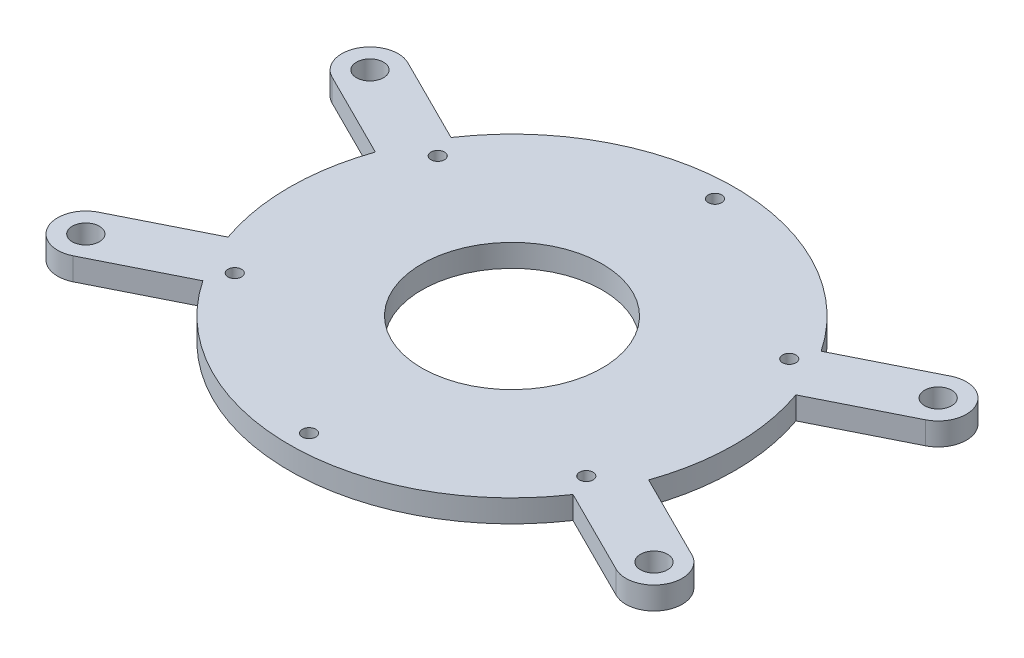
ISO-10303-21;
HEADER;
FILE_DESCRIPTION(('STEP AP214'),'2;1');
FILE_NAME('part.step','',(''),(''),'','','');
FILE_SCHEMA(('AUTOMOTIVE_DESIGN { 1 0 10303 214 1 1 1 1 }'));
ENDSEC;
DATA;
#1=APPLICATION_CONTEXT('core data for automotive mechanical design processes');
#2=APPLICATION_PROTOCOL_DEFINITION('international standard','automotive_design',2000,#1);
#3=PRODUCT_CONTEXT('',#1,'mechanical');
#4=PRODUCT('Part','Part','',(#3));
#5=PRODUCT_RELATED_PRODUCT_CATEGORY('part','',(#4));
#6=PRODUCT_DEFINITION_FORMATION('','',#4);
#7=PRODUCT_DEFINITION_CONTEXT('part definition',#1,'design');
#8=PRODUCT_DEFINITION('design','',#6,#7);
#9=PRODUCT_DEFINITION_SHAPE('','',#8);
#10=(LENGTH_UNIT() NAMED_UNIT(*) SI_UNIT(.MILLI.,.METRE.));
#11=(NAMED_UNIT(*) PLANE_ANGLE_UNIT() SI_UNIT($,.RADIAN.));
#12=(NAMED_UNIT(*) SI_UNIT($,.STERADIAN.) SOLID_ANGLE_UNIT());
#13=UNCERTAINTY_MEASURE_WITH_UNIT(LENGTH_MEASURE(1.E-05),#10,'distance_accuracy_value','');
#14=(GEOMETRIC_REPRESENTATION_CONTEXT(3) GLOBAL_UNCERTAINTY_ASSIGNED_CONTEXT((#13)) GLOBAL_UNIT_ASSIGNED_CONTEXT((#10,
#11,#12)) REPRESENTATION_CONTEXT('',''));
#15=CARTESIAN_POINT('',(0.,0.,0.));
#16=DIRECTION('',(0.,0.,1.));
#17=DIRECTION('',(1.,0.,0.));
#18=AXIS2_PLACEMENT_3D('',#15,#16,#17);
#19=CARTESIAN_POINT('',(0.,5.,0.));
#20=DIRECTION('',(0.,-1.,0.));
#21=DIRECTION('',(0.,0.,-1.));
#22=AXIS2_PLACEMENT_3D('',#19,#20,#21);
#23=CYLINDRICAL_SURFACE('',#22,49.4);
#24=CARTESIAN_POINT('',(0.,0.,0.));
#25=DIRECTION('',(0.,1.,0.));
#26=DIRECTION('',(0.,0.,1.));
#27=AXIS2_PLACEMENT_3D('',#24,#25,#26);
#28=CIRCLE('',#27,49.4);
#29=CARTESIAN_POINT('',(-41.0321866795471,0.,27.5085378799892));
#30=VERTEX_POINT('',#29);
#31=CARTESIAN_POINT('',(41.0321866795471,0.,27.5085378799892));
#32=VERTEX_POINT('',#31);
#33=EDGE_CURVE('E246',#30,#32,#28,.T.);
#34=ORIENTED_EDGE('',*,*,#33,.T.);
#35=DIRECTION('',(0.,-1.,0.));
#36=VECTOR('',#35,1.);
#37=CARTESIAN_POINT('',(41.0321866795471,5.,27.5085378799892));
#38=LINE('',#37,#36);
#39=CARTESIAN_POINT('',(41.0321866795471,5.,27.5085378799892));
#40=VERTEX_POINT('',#39);
#41=EDGE_CURVE('E12',#40,#32,#38,.T.);
#42=ORIENTED_EDGE('',*,*,#41,.F.);
#43=CARTESIAN_POINT('',(0.,5.,0.));
#44=DIRECTION('',(0.,1.,0.));
#45=DIRECTION('',(0.,0.,1.));
#46=AXIS2_PLACEMENT_3D('',#43,#44,#45);
#47=CIRCLE('',#46,49.4);
#48=CARTESIAN_POINT('',(-41.0321866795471,5.,27.5085378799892));
#49=VERTEX_POINT('',#48);
#50=EDGE_CURVE('E176',#49,#40,#47,.T.);
#51=ORIENTED_EDGE('',*,*,#50,.F.);
#52=DIRECTION('',(0.,-1.,0.));
#53=VECTOR('',#52,1.);
#54=CARTESIAN_POINT('',(-41.0321866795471,5.,27.5085378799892));
#55=LINE('',#54,#53);
#56=EDGE_CURVE('E242',#49,#30,#55,.T.);
#57=ORIENTED_EDGE('',*,*,#56,.T.);
#58=EDGE_LOOP('',(#34,#42,#51,#57));
#59=FACE_BOUND('',#58,.T.);
#60=ADVANCED_FACE('F94',(#59),#23,.T.);
#61=CARTESIAN_POINT('',(-2.79556780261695,5.,5.5899285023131));
#62=DIRECTION('',(-0.447290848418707,0.,0.894388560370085));
#63=DIRECTION('',(0.894388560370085,0.,0.447290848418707));
#64=AXIS2_PLACEMENT_3D('',#61,#62,#63);
#65=PLANE('',#64);
#66=DIRECTION('',(-0.894388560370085,0.,-0.447290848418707));
#67=VECTOR('',#66,1.);
#68=CARTESIAN_POINT('',(-2.79556780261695,0.,5.5899285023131));
#69=LINE('',#68,#67);
#70=CARTESIAN_POINT('',(60.1908307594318,0.,37.089928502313));
#71=VERTEX_POINT('',#70);
#72=EDGE_CURVE('E250',#71,#32,#69,.T.);
#73=ORIENTED_EDGE('',*,*,#72,.F.);
#74=DIRECTION('',(0.,-1.,0.));
#75=VECTOR('',#74,1.);
#76=CARTESIAN_POINT('',(60.1908307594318,5.,37.089928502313));
#77=LINE('',#76,#75);
#78=CARTESIAN_POINT('',(60.1908307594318,5.,37.089928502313));
#79=VERTEX_POINT('',#78);
#80=EDGE_CURVE('E104',#79,#71,#77,.T.);
#81=ORIENTED_EDGE('',*,*,#80,.F.);
#82=DIRECTION('',(-0.894388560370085,0.,-0.447290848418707));
#83=VECTOR('',#82,1.);
#84=CARTESIAN_POINT('',(-2.79556780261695,5.,5.5899285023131));
#85=LINE('',#84,#83);
#86=EDGE_CURVE('E326',#79,#40,#85,.T.);
#87=ORIENTED_EDGE('',*,*,#86,.T.);
#88=ORIENTED_EDGE('',*,*,#41,.T.);
#89=EDGE_LOOP('',(#73,#81,#87,#88));
#90=FACE_BOUND('',#89,.T.);
#91=ADVANCED_FACE('F407',(#90),#65,.T.);
#92=CARTESIAN_POINT('',(62.9863985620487,5.,31.5));
#93=DIRECTION('',(0.,-1.,0.));
#94=DIRECTION('',(0.,0.,-1.));
#95=AXIS2_PLACEMENT_3D('',#92,#93,#94);
#96=CYLINDRICAL_SURFACE('',#95,6.25);
#97=CARTESIAN_POINT('',(62.9863985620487,0.,31.5));
#98=DIRECTION('',(0.,1.,0.));
#99=DIRECTION('',(0.,0.,1.));
#100=AXIS2_PLACEMENT_3D('',#97,#98,#99);
#101=CIRCLE('',#100,6.25);
#102=CARTESIAN_POINT('',(65.7819663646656,0.,25.9100714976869));
#103=VERTEX_POINT('',#102);
#104=EDGE_CURVE('E255',#103,#71,#101,.F.);
#105=ORIENTED_EDGE('',*,*,#104,.F.);
#106=DIRECTION('',(0.,-1.,0.));
#107=VECTOR('',#106,1.);
#108=CARTESIAN_POINT('',(65.7819663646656,5.,25.9100714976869));
#109=LINE('',#108,#107);
#110=CARTESIAN_POINT('',(65.7819663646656,5.,25.9100714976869));
#111=VERTEX_POINT('',#110);
#112=EDGE_CURVE('E302',#111,#103,#109,.T.);
#113=ORIENTED_EDGE('',*,*,#112,.F.);
#114=CARTESIAN_POINT('',(62.9863985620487,5.,31.5));
#115=DIRECTION('',(0.,1.,0.));
#116=DIRECTION('',(0.,0.,1.));
#117=AXIS2_PLACEMENT_3D('',#114,#115,#116);
#118=CIRCLE('',#117,6.25);
#119=EDGE_CURVE('E330',#111,#79,#118,.F.);
#120=ORIENTED_EDGE('',*,*,#119,.T.);
#121=ORIENTED_EDGE('',*,*,#80,.T.);
#122=EDGE_LOOP('',(#105,#113,#120,#121));
#123=FACE_BOUND('',#122,.T.);
#124=ADVANCED_FACE('F412',(#123),#96,.T.);
#125=CARTESIAN_POINT('',(2.79556780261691,5.,-5.58992850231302));
#126=DIRECTION('',(-0.447290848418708,0.,0.894388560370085));
#127=DIRECTION('',(0.894388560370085,0.,0.447290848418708));
#128=AXIS2_PLACEMENT_3D('',#125,#126,#127);
#129=PLANE('',#128);
#130=DIRECTION('',(-0.894388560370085,0.,-0.447290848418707));
#131=VECTOR('',#130,1.);
#132=CARTESIAN_POINT('',(2.79556780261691,0.,-5.58992850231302));
#133=LINE('',#132,#131);
#134=CARTESIAN_POINT('',(46.623322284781,0.,16.3286808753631));
#135=VERTEX_POINT('',#134);
#136=EDGE_CURVE('E258',#103,#135,#133,.T.);
#137=ORIENTED_EDGE('',*,*,#136,.T.);
#138=DIRECTION('',(0.,-1.,0.));
#139=VECTOR('',#138,1.);
#140=CARTESIAN_POINT('',(46.623322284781,5.,16.3286808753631));
#141=LINE('',#140,#139);
#142=CARTESIAN_POINT('',(46.623322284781,5.,16.3286808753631));
#143=VERTEX_POINT('',#142);
#144=EDGE_CURVE('E299',#143,#135,#141,.T.);
#145=ORIENTED_EDGE('',*,*,#144,.F.);
#146=DIRECTION('',(-0.894388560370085,0.,-0.447290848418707));
#147=VECTOR('',#146,1.);
#148=CARTESIAN_POINT('',(2.79556780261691,5.,-5.58992850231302));
#149=LINE('',#148,#147);
#150=EDGE_CURVE('E333',#111,#143,#149,.T.);
#151=ORIENTED_EDGE('',*,*,#150,.F.);
#152=ORIENTED_EDGE('',*,*,#112,.T.);
#153=EDGE_LOOP('',(#137,#145,#151,#152));
#154=FACE_BOUND('',#153,.T.);
#155=ADVANCED_FACE('F418',(#154),#129,.F.);
#156=CARTESIAN_POINT('',(46.6233222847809,0.,-16.3286808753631));
#157=VERTEX_POINT('',#156);
#158=EDGE_CURVE('E252',#135,#157,#28,.T.);
#159=ORIENTED_EDGE('',*,*,#158,.T.);
#160=DIRECTION('',(0.,-1.,0.));
#161=VECTOR('',#160,1.);
#162=CARTESIAN_POINT('',(46.6233222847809,5.,-16.3286808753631));
#163=LINE('',#162,#161);
#164=CARTESIAN_POINT('',(46.6233222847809,5.,-16.3286808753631));
#165=VERTEX_POINT('',#164);
#166=EDGE_CURVE('E297',#165,#157,#163,.T.);
#167=ORIENTED_EDGE('',*,*,#166,.F.);
#168=EDGE_CURVE('E327',#143,#165,#47,.T.);
#169=ORIENTED_EDGE('',*,*,#168,.F.);
#170=ORIENTED_EDGE('',*,*,#144,.T.);
#171=EDGE_LOOP('',(#159,#167,#169,#170));
#172=FACE_BOUND('',#171,.T.);
#173=ADVANCED_FACE('F354',(#172),#23,.T.);
#174=CARTESIAN_POINT('',(2.79556780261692,5.,5.58992850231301));
#175=DIRECTION('',(0.447290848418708,0.,0.894388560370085));
#176=DIRECTION('',(0.894388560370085,0.,-0.447290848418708));
#177=AXIS2_PLACEMENT_3D('',#174,#175,#176);
#178=PLANE('',#177);
#179=DIRECTION('',(-0.894388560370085,0.,0.447290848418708));
#180=VECTOR('',#179,1.);
#181=CARTESIAN_POINT('',(2.79556780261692,0.,5.58992850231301));
#182=LINE('',#181,#180);
#183=CARTESIAN_POINT('',(65.7819663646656,0.,-25.910071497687));
#184=VERTEX_POINT('',#183);
#185=EDGE_CURVE('E260',#184,#157,#182,.T.);
#186=ORIENTED_EDGE('',*,*,#185,.F.);
#187=DIRECTION('',(0.,-1.,0.));
#188=VECTOR('',#187,1.);
#189=CARTESIAN_POINT('',(65.7819663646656,5.,-25.910071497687));
#190=LINE('',#189,#188);
#191=CARTESIAN_POINT('',(65.7819663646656,5.,-25.910071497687));
#192=VERTEX_POINT('',#191);
#193=EDGE_CURVE('E295',#192,#184,#190,.T.);
#194=ORIENTED_EDGE('',*,*,#193,.F.);
#195=DIRECTION('',(-0.894388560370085,0.,0.447290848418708));
#196=VECTOR('',#195,1.);
#197=CARTESIAN_POINT('',(2.79556780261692,5.,5.58992850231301));
#198=LINE('',#197,#196);
#199=EDGE_CURVE('E335',#192,#165,#198,.T.);
#200=ORIENTED_EDGE('',*,*,#199,.T.);
#201=ORIENTED_EDGE('',*,*,#166,.T.);
#202=EDGE_LOOP('',(#186,#194,#200,#201));
#203=FACE_BOUND('',#202,.T.);
#204=ADVANCED_FACE('F358',(#203),#178,.T.);
#205=CARTESIAN_POINT('',(62.9863985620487,5.,-31.5));
#206=DIRECTION('',(0.,-1.,0.));
#207=DIRECTION('',(0.,0.,-1.));
#208=AXIS2_PLACEMENT_3D('',#205,#206,#207);
#209=CYLINDRICAL_SURFACE('',#208,6.25);
#210=CARTESIAN_POINT('',(62.9863985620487,0.,-31.5));
#211=DIRECTION('',(0.,1.,0.));
#212=DIRECTION('',(0.,0.,1.));
#213=AXIS2_PLACEMENT_3D('',#210,#211,#212);
#214=CIRCLE('',#213,6.25);
#215=CARTESIAN_POINT('',(60.1908307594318,0.,-37.089928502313));
#216=VERTEX_POINT('',#215);
#217=EDGE_CURVE('E263',#184,#216,#214,.T.);
#218=ORIENTED_EDGE('',*,*,#217,.T.);
#219=DIRECTION('',(0.,-1.,0.));
#220=VECTOR('',#219,1.);
#221=CARTESIAN_POINT('',(60.1908307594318,5.,-37.089928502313));
#222=LINE('',#221,#220);
#223=CARTESIAN_POINT('',(60.1908307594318,5.,-37.089928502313));
#224=VERTEX_POINT('',#223);
#225=EDGE_CURVE('E292',#224,#216,#222,.T.);
#226=ORIENTED_EDGE('',*,*,#225,.F.);
#227=CARTESIAN_POINT('',(62.9863985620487,5.,-31.5));
#228=DIRECTION('',(0.,1.,0.));
#229=DIRECTION('',(0.,0.,1.));
#230=AXIS2_PLACEMENT_3D('',#227,#228,#229);
#231=CIRCLE('',#230,6.25);
#232=EDGE_CURVE('E338',#192,#224,#231,.T.);
#233=ORIENTED_EDGE('',*,*,#232,.F.);
#234=ORIENTED_EDGE('',*,*,#193,.T.);
#235=EDGE_LOOP('',(#218,#226,#233,#234));
#236=FACE_BOUND('',#235,.T.);
#237=ADVANCED_FACE('F363',(#236),#209,.T.);
#238=CARTESIAN_POINT('',(-2.79556780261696,5.,-5.58992850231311));
#239=DIRECTION('',(0.447290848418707,0.,0.894388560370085));
#240=DIRECTION('',(0.894388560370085,0.,-0.447290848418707));
#241=AXIS2_PLACEMENT_3D('',#238,#239,#240);
#242=PLANE('',#241);
#243=DIRECTION('',(-0.894388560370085,0.,0.447290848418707));
#244=VECTOR('',#243,1.);
#245=CARTESIAN_POINT('',(-2.79556780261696,0.,-5.58992850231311));
#246=LINE('',#245,#244);
#247=CARTESIAN_POINT('',(41.0321866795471,0.,-27.5085378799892));
#248=VERTEX_POINT('',#247);
#249=EDGE_CURVE('E265',#216,#248,#246,.T.);
#250=ORIENTED_EDGE('',*,*,#249,.T.);
#251=DIRECTION('',(0.,-1.,0.));
#252=VECTOR('',#251,1.);
#253=CARTESIAN_POINT('',(41.0321866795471,5.,-27.5085378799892));
#254=LINE('',#253,#252);
#255=CARTESIAN_POINT('',(41.0321866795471,5.,-27.5085378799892));
#256=VERTEX_POINT('',#255);
#257=EDGE_CURVE('E289',#256,#248,#254,.T.);
#258=ORIENTED_EDGE('',*,*,#257,.F.);
#259=DIRECTION('',(-0.894388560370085,0.,0.447290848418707));
#260=VECTOR('',#259,1.);
#261=CARTESIAN_POINT('',(-2.79556780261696,5.,-5.58992850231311));
#262=LINE('',#261,#260);
#263=EDGE_CURVE('E340',#224,#256,#262,.T.);
#264=ORIENTED_EDGE('',*,*,#263,.F.);
#265=ORIENTED_EDGE('',*,*,#225,.T.);
#266=EDGE_LOOP('',(#250,#258,#264,#265));
#267=FACE_BOUND('',#266,.T.);
#268=ADVANCED_FACE('F367',(#267),#242,.F.);
#269=CARTESIAN_POINT('',(-41.0321866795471,0.,-27.5085378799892));
#270=VERTEX_POINT('',#269);
#271=EDGE_CURVE('E267',#248,#270,#28,.T.);
#272=ORIENTED_EDGE('',*,*,#271,.T.);
#273=DIRECTION('',(0.,-1.,0.));
#274=VECTOR('',#273,1.);
#275=CARTESIAN_POINT('',(-41.0321866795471,5.,-27.5085378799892));
#276=LINE('',#275,#274);
#277=CARTESIAN_POINT('',(-41.0321866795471,5.,-27.5085378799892));
#278=VERTEX_POINT('',#277);
#279=EDGE_CURVE('E287',#278,#270,#276,.T.);
#280=ORIENTED_EDGE('',*,*,#279,.F.);
#281=EDGE_CURVE('E237',#256,#278,#47,.T.);
#282=ORIENTED_EDGE('',*,*,#281,.F.);
#283=ORIENTED_EDGE('',*,*,#257,.T.);
#284=EDGE_LOOP('',(#272,#280,#282,#283));
#285=FACE_BOUND('',#284,.T.);
#286=ADVANCED_FACE('F372',(#285),#23,.T.);
#287=CARTESIAN_POINT('',(2.79556780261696,5.,-5.58992850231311));
#288=DIRECTION('',(0.447290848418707,0.,-0.894388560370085));
#289=DIRECTION('',(-0.894388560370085,0.,-0.447290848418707));
#290=AXIS2_PLACEMENT_3D('',#287,#288,#289);
#291=PLANE('',#290);
#292=DIRECTION('',(0.894388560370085,0.,0.447290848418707));
#293=VECTOR('',#292,1.);
#294=CARTESIAN_POINT('',(2.79556780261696,0.,-5.58992850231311));
#295=LINE('',#294,#293);
#296=CARTESIAN_POINT('',(-60.1908307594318,0.,-37.089928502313));
#297=VERTEX_POINT('',#296);
#298=EDGE_CURVE('E268',#297,#270,#295,.T.);
#299=ORIENTED_EDGE('',*,*,#298,.F.);
#300=DIRECTION('',(0.,-1.,0.));
#301=VECTOR('',#300,1.);
#302=CARTESIAN_POINT('',(-60.1908307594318,5.,-37.089928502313));
#303=LINE('',#302,#301);
#304=CARTESIAN_POINT('',(-60.1908307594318,5.,-37.089928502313));
#305=VERTEX_POINT('',#304);
#306=EDGE_CURVE('E285',#305,#297,#303,.T.);
#307=ORIENTED_EDGE('',*,*,#306,.F.);
#308=DIRECTION('',(0.894388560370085,0.,0.447290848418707));
#309=VECTOR('',#308,1.);
#310=CARTESIAN_POINT('',(2.79556780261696,5.,-5.58992850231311));
#311=LINE('',#310,#309);
#312=EDGE_CURVE('E341',#305,#278,#311,.T.);
#313=ORIENTED_EDGE('',*,*,#312,.T.);
#314=ORIENTED_EDGE('',*,*,#279,.T.);
#315=EDGE_LOOP('',(#299,#307,#313,#314));
#316=FACE_BOUND('',#315,.T.);
#317=ADVANCED_FACE('F373',(#316),#291,.T.);
#318=CARTESIAN_POINT('',(-2.7955678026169,5.,5.58992850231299));
#319=DIRECTION('',(0.447290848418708,0.,-0.894388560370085));
#320=DIRECTION('',(-0.894388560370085,0.,-0.447290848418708));
#321=AXIS2_PLACEMENT_3D('',#318,#319,#320);
#322=PLANE('',#321);
#323=DIRECTION('',(0.894388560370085,0.,0.447290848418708));
#324=VECTOR('',#323,1.);
#325=CARTESIAN_POINT('',(-2.7955678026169,0.,5.58992850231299));
#326=LINE('',#325,#324);
#327=CARTESIAN_POINT('',(-65.7819663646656,0.,-25.9100714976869));
#328=VERTEX_POINT('',#327);
#329=CARTESIAN_POINT('',(-46.6233222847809,0.,-16.3286808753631));
#330=VERTEX_POINT('',#329);
#331=EDGE_CURVE('E271',#328,#330,#326,.T.);
#332=ORIENTED_EDGE('',*,*,#331,.T.);
#333=DIRECTION('',(0.,-1.,0.));
#334=VECTOR('',#333,1.);
#335=CARTESIAN_POINT('',(-46.6233222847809,5.,-16.3286808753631));
#336=LINE('',#335,#334);
#337=CARTESIAN_POINT('',(-46.6233222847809,5.,-16.3286808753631));
#338=VERTEX_POINT('',#337);
#339=EDGE_CURVE('E280',#338,#330,#336,.T.);
#340=ORIENTED_EDGE('',*,*,#339,.F.);
#341=DIRECTION('',(0.894388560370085,0.,0.447290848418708));
#342=VECTOR('',#341,1.);
#343=CARTESIAN_POINT('',(-2.7955678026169,5.,5.58992850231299));
#344=LINE('',#343,#342);
#345=CARTESIAN_POINT('',(-65.7819663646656,5.,-25.9100714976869));
#346=VERTEX_POINT('',#345);
#347=EDGE_CURVE('E235',#346,#338,#344,.T.);
#348=ORIENTED_EDGE('',*,*,#347,.F.);
#349=DIRECTION('',(0.,-1.,0.));
#350=VECTOR('',#349,1.);
#351=CARTESIAN_POINT('',(-65.7819663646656,5.,-25.9100714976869));
#352=LINE('',#351,#350);
#353=EDGE_CURVE('E283',#346,#328,#352,.T.);
#354=ORIENTED_EDGE('',*,*,#353,.T.);
#355=EDGE_LOOP('',(#332,#340,#348,#354));
#356=FACE_BOUND('',#355,.T.);
#357=ADVANCED_FACE('F420',(#356),#322,.F.);
#358=CARTESIAN_POINT('',(-46.6233222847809,0.,16.3286808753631));
#359=VERTEX_POINT('',#358);
#360=EDGE_CURVE('E251',#330,#359,#28,.T.);
#361=ORIENTED_EDGE('',*,*,#360,.T.);
#362=DIRECTION('',(0.,-1.,0.));
#363=VECTOR('',#362,1.);
#364=CARTESIAN_POINT('',(-46.6233222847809,5.,16.3286808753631));
#365=LINE('',#364,#363);
#366=CARTESIAN_POINT('',(-46.6233222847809,5.,16.3286808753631));
#367=VERTEX_POINT('',#366);
#368=EDGE_CURVE('E224',#367,#359,#365,.T.);
#369=ORIENTED_EDGE('',*,*,#368,.F.);
#370=EDGE_CURVE('E232',#338,#367,#47,.T.);
#371=ORIENTED_EDGE('',*,*,#370,.F.);
#372=ORIENTED_EDGE('',*,*,#339,.T.);
#373=EDGE_LOOP('',(#361,#369,#371,#372));
#374=FACE_BOUND('',#373,.T.);
#375=ADVANCED_FACE('F379',(#374),#23,.T.);
#376=CARTESIAN_POINT('',(-2.7955678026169,5.,-5.58992850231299));
#377=DIRECTION('',(-0.447290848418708,0.,-0.894388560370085));
#378=DIRECTION('',(-0.894388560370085,0.,0.447290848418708));
#379=AXIS2_PLACEMENT_3D('',#376,#377,#378);
#380=PLANE('',#379);
#381=DIRECTION('',(0.894388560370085,0.,-0.447290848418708));
#382=VECTOR('',#381,1.);
#383=CARTESIAN_POINT('',(-2.7955678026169,0.,-5.58992850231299));
#384=LINE('',#383,#382);
#385=CARTESIAN_POINT('',(-65.7819663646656,0.,25.9100714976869));
#386=VERTEX_POINT('',#385);
#387=EDGE_CURVE('E223',#386,#359,#384,.T.);
#388=ORIENTED_EDGE('',*,*,#387,.F.);
#389=DIRECTION('',(0.,-1.,0.));
#390=VECTOR('',#389,1.);
#391=CARTESIAN_POINT('',(-65.7819663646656,5.,25.9100714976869));
#392=LINE('',#391,#390);
#393=CARTESIAN_POINT('',(-65.7819663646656,5.,25.9100714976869));
#394=VERTEX_POINT('',#393);
#395=EDGE_CURVE('E217',#394,#386,#392,.T.);
#396=ORIENTED_EDGE('',*,*,#395,.F.);
#397=DIRECTION('',(0.894388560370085,0.,-0.447290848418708));
#398=VECTOR('',#397,1.);
#399=CARTESIAN_POINT('',(-2.7955678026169,5.,-5.58992850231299));
#400=LINE('',#399,#398);
#401=EDGE_CURVE('E221',#394,#367,#400,.T.);
#402=ORIENTED_EDGE('',*,*,#401,.T.);
#403=ORIENTED_EDGE('',*,*,#368,.T.);
#404=EDGE_LOOP('',(#388,#396,#402,#403));
#405=FACE_BOUND('',#404,.T.);
#406=ADVANCED_FACE('F219',(#405),#380,.T.);
#407=CARTESIAN_POINT('',(-62.9863985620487,5.,31.5));
#408=DIRECTION('',(0.,-1.,0.));
#409=DIRECTION('',(0.,0.,-1.));
#410=AXIS2_PLACEMENT_3D('',#407,#408,#409);
#411=CYLINDRICAL_SURFACE('',#410,6.25000000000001);
#412=CARTESIAN_POINT('',(-62.9863985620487,0.,31.5));
#413=DIRECTION('',(0.,1.,0.));
#414=DIRECTION('',(0.,0.,1.));
#415=AXIS2_PLACEMENT_3D('',#412,#413,#414);
#416=CIRCLE('',#415,6.25000000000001);
#417=CARTESIAN_POINT('',(-60.1908307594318,0.,37.089928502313));
#418=VERTEX_POINT('',#417);
#419=EDGE_CURVE('E164',#386,#418,#416,.T.);
#420=ORIENTED_EDGE('',*,*,#419,.T.);
#421=DIRECTION('',(0.,-1.,0.));
#422=VECTOR('',#421,1.);
#423=CARTESIAN_POINT('',(-60.1908307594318,5.,37.089928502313));
#424=LINE('',#423,#422);
#425=CARTESIAN_POINT('',(-60.1908307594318,5.,37.089928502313));
#426=VERTEX_POINT('',#425);
#427=EDGE_CURVE('E225',#426,#418,#424,.T.);
#428=ORIENTED_EDGE('',*,*,#427,.F.);
#429=CARTESIAN_POINT('',(-62.9863985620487,5.,31.5));
#430=DIRECTION('',(0.,1.,0.));
#431=DIRECTION('',(0.,0.,1.));
#432=AXIS2_PLACEMENT_3D('',#429,#430,#431);
#433=CIRCLE('',#432,6.25000000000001);
#434=EDGE_CURVE('E227',#394,#426,#433,.T.);
#435=ORIENTED_EDGE('',*,*,#434,.F.);
#436=ORIENTED_EDGE('',*,*,#395,.T.);
#437=EDGE_LOOP('',(#420,#428,#435,#436));
#438=FACE_BOUND('',#437,.T.);
#439=ADVANCED_FACE('F228',(#438),#411,.T.);
#440=CARTESIAN_POINT('',(0.,5.,0.));
#441=DIRECTION('',(0.,-1.,0.));
#442=DIRECTION('',(0.,0.,-1.));
#443=AXIS2_PLACEMENT_3D('',#440,#441,#442);
#444=CYLINDRICAL_SURFACE('',#443,20.);
#445=CARTESIAN_POINT('',(0.,5.,0.));
#446=DIRECTION('',(0.,1.,0.));
#447=DIRECTION('',(0.,0.,1.));
#448=AXIS2_PLACEMENT_3D('',#445,#446,#447);
#449=CIRCLE('',#448,20.);
#450=CARTESIAN_POINT('',(0.,5.,20.));
#451=VERTEX_POINT('',#450);
#452=EDGE_CURVE('E276',#451,#451,#449,.T.);
#453=ORIENTED_EDGE('',*,*,#452,.T.);
#454=EDGE_LOOP('',(#453));
#455=FACE_BOUND('',#454,.T.);
#456=CARTESIAN_POINT('',(0.,0.,0.));
#457=DIRECTION('',(0.,1.,0.));
#458=DIRECTION('',(0.,0.,1.));
#459=AXIS2_PLACEMENT_3D('',#456,#457,#458);
#460=CIRCLE('',#459,20.);
#461=CARTESIAN_POINT('',(0.,0.,20.));
#462=VERTEX_POINT('',#461);
#463=EDGE_CURVE('E243',#462,#462,#460,.T.);
#464=ORIENTED_EDGE('',*,*,#463,.F.);
#465=EDGE_LOOP('',(#464));
#466=FACE_BOUND('',#465,.T.);
#467=ADVANCED_FACE('F385',(#455,#466),#444,.F.);
#468=CARTESIAN_POINT('',(2.79556780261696,5.,5.58992850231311));
#469=DIRECTION('',(-0.447290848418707,0.,-0.894388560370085));
#470=DIRECTION('',(-0.894388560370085,0.,0.447290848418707));
#471=AXIS2_PLACEMENT_3D('',#468,#469,#470);
#472=PLANE('',#471);
#473=DIRECTION('',(0.894388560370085,0.,-0.447290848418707));
#474=VECTOR('',#473,1.);
#475=CARTESIAN_POINT('',(2.79556780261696,0.,5.58992850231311));
#476=LINE('',#475,#474);
#477=EDGE_CURVE('E170',#418,#30,#476,.T.);
#478=ORIENTED_EDGE('',*,*,#477,.T.);
#479=ORIENTED_EDGE('',*,*,#56,.F.);
#480=DIRECTION('',(0.894388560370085,0.,-0.447290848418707));
#481=VECTOR('',#480,1.);
#482=CARTESIAN_POINT('',(2.79556780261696,5.,5.58992850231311));
#483=LINE('',#482,#481);
#484=EDGE_CURVE('E113',#426,#49,#483,.T.);
#485=ORIENTED_EDGE('',*,*,#484,.F.);
#486=ORIENTED_EDGE('',*,*,#427,.T.);
#487=EDGE_LOOP('',(#478,#479,#485,#486));
#488=FACE_BOUND('',#487,.T.);
#489=ADVANCED_FACE('F383',(#488),#472,.F.);
#490=CARTESIAN_POINT('',(0.,5.,0.));
#491=DIRECTION('',(0.,1.,0.));
#492=DIRECTION('',(0.,0.,1.));
#493=AXIS2_PLACEMENT_3D('',#490,#491,#492);
#494=PLANE('',#493);
#495=CARTESIAN_POINT('',(-38.9711431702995,5.,22.5000000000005));
#496=DIRECTION('',(0.,-1.,0.));
#497=DIRECTION('',(0.866025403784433,0.,-0.50000000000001));
#498=AXIS2_PLACEMENT_3D('',#495,#496,#497);
#499=CIRCLE('',#498,1.5);
#500=CARTESIAN_POINT('',(-37.6721050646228,5.,21.7500000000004));
#501=VERTEX_POINT('',#500);
#502=EDGE_CURVE('E670',#501,#501,#499,.T.);
#503=ORIENTED_EDGE('',*,*,#502,.T.);
#504=EDGE_LOOP('',(#503));
#505=FACE_BOUND('',#504,.T.);
#506=CARTESIAN_POINT('',(-38.9711431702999,5.,-22.4999999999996));
#507=DIRECTION('',(0.,-1.,0.));
#508=DIRECTION('',(0.866025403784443,0.,0.499999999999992));
#509=AXIS2_PLACEMENT_3D('',#506,#507,#508);
#510=CIRCLE('',#509,1.5);
#511=CARTESIAN_POINT('',(-37.6721050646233,5.,-21.7499999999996));
#512=VERTEX_POINT('',#511);
#513=EDGE_CURVE('E751',#512,#512,#510,.T.);
#514=ORIENTED_EDGE('',*,*,#513,.T.);
#515=EDGE_LOOP('',(#514));
#516=FACE_BOUND('',#515,.T.);
#517=CARTESIAN_POINT('',(0.,5.,-45.));
#518=DIRECTION('',(0.,-1.,0.));
#519=DIRECTION('',(0.,0.,1.));
#520=AXIS2_PLACEMENT_3D('',#517,#518,#519);
#521=CIRCLE('',#520,1.5);
#522=CARTESIAN_POINT('',(0.,5.,-43.5));
#523=VERTEX_POINT('',#522);
#524=EDGE_CURVE('E743',#523,#523,#521,.T.);
#525=ORIENTED_EDGE('',*,*,#524,.T.);
#526=EDGE_LOOP('',(#525));
#527=FACE_BOUND('',#526,.T.);
#528=CARTESIAN_POINT('',(38.9711431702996,5.,-22.5000000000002));
#529=DIRECTION('',(0.,-1.,0.));
#530=DIRECTION('',(-0.866025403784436,0.,0.500000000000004));
#531=AXIS2_PLACEMENT_3D('',#528,#529,#530);
#532=CIRCLE('',#531,1.5);
#533=CARTESIAN_POINT('',(37.672105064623,5.,-21.7500000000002));
#534=VERTEX_POINT('',#533);
#535=EDGE_CURVE('E686',#534,#534,#532,.T.);
#536=ORIENTED_EDGE('',*,*,#535,.T.);
#537=EDGE_LOOP('',(#536));
#538=FACE_BOUND('',#537,.T.);
#539=CARTESIAN_POINT('',(38.9711431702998,5.,22.4999999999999));
#540=DIRECTION('',(0.,-1.,0.));
#541=DIRECTION('',(-0.86602540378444,0.,-0.499999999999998));
#542=AXIS2_PLACEMENT_3D('',#539,#540,#541);
#543=CIRCLE('',#542,1.5);
#544=CARTESIAN_POINT('',(37.6721050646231,5.,21.7499999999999));
#545=VERTEX_POINT('',#544);
#546=EDGE_CURVE('E679',#545,#545,#543,.T.);
#547=ORIENTED_EDGE('',*,*,#546,.T.);
#548=EDGE_LOOP('',(#547));
#549=FACE_BOUND('',#548,.T.);
#550=CARTESIAN_POINT('',(0.,5.,45.));
#551=DIRECTION('',(0.,-1.,0.));
#552=DIRECTION('',(0.,0.,-1.));
#553=AXIS2_PLACEMENT_3D('',#550,#551,#552);
#554=CIRCLE('',#553,1.5);
#555=CARTESIAN_POINT('',(0.,5.,43.5));
#556=VERTEX_POINT('',#555);
#557=EDGE_CURVE('E687',#556,#556,#554,.T.);
#558=ORIENTED_EDGE('',*,*,#557,.T.);
#559=EDGE_LOOP('',(#558));
#560=FACE_BOUND('',#559,.T.);
#561=CARTESIAN_POINT('',(62.9863985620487,5.,-31.5));
#562=DIRECTION('',(0.,-1.,0.));
#563=DIRECTION('',(0.,0.,1.));
#564=AXIS2_PLACEMENT_3D('',#561,#562,#563);
#565=CIRCLE('',#564,3.00000000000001);
#566=CARTESIAN_POINT('',(62.9863985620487,5.,-28.5));
#567=VERTEX_POINT('',#566);
#568=EDGE_CURVE('E693',#567,#567,#565,.T.);
#569=ORIENTED_EDGE('',*,*,#568,.T.);
#570=EDGE_LOOP('',(#569));
#571=FACE_BOUND('',#570,.T.);
#572=CARTESIAN_POINT('',(62.9863985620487,5.,31.5));
#573=DIRECTION('',(0.,1.,0.));
#574=DIRECTION('',(0.,0.,-1.));
#575=AXIS2_PLACEMENT_3D('',#572,#573,#574);
#576=CIRCLE('',#575,3.00000000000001);
#577=CARTESIAN_POINT('',(62.9863985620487,5.,28.5));
#578=VERTEX_POINT('',#577);
#579=EDGE_CURVE('E696',#578,#578,#576,.T.);
#580=ORIENTED_EDGE('',*,*,#579,.F.);
#581=EDGE_LOOP('',(#580));
#582=FACE_BOUND('',#581,.T.);
#583=CARTESIAN_POINT('',(-62.9863985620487,5.,31.5));
#584=DIRECTION('',(0.,-1.,0.));
#585=DIRECTION('',(0.,0.,-1.));
#586=AXIS2_PLACEMENT_3D('',#583,#584,#585);
#587=CIRCLE('',#586,3.00000000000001);
#588=CARTESIAN_POINT('',(-62.9863985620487,5.,28.5));
#589=VERTEX_POINT('',#588);
#590=EDGE_CURVE('E320',#589,#589,#587,.T.);
#591=ORIENTED_EDGE('',*,*,#590,.T.);
#592=EDGE_LOOP('',(#591));
#593=FACE_BOUND('',#592,.T.);
#594=CARTESIAN_POINT('',(-62.9863985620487,5.,-31.5));
#595=DIRECTION('',(0.,1.,0.));
#596=DIRECTION('',(0.,0.,1.));
#597=AXIS2_PLACEMENT_3D('',#594,#595,#596);
#598=CIRCLE('',#597,3.00000000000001);
#599=CARTESIAN_POINT('',(-62.9863985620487,5.,-28.5));
#600=VERTEX_POINT('',#599);
#601=EDGE_CURVE('E315',#600,#600,#598,.T.);
#602=ORIENTED_EDGE('',*,*,#601,.F.);
#603=EDGE_LOOP('',(#602));
#604=FACE_BOUND('',#603,.T.);
#605=ORIENTED_EDGE('',*,*,#452,.F.);
#606=EDGE_LOOP('',(#605));
#607=FACE_BOUND('',#606,.T.);
#608=ORIENTED_EDGE('',*,*,#50,.T.);
#609=ORIENTED_EDGE('',*,*,#86,.F.);
#610=ORIENTED_EDGE('',*,*,#119,.F.);
#611=ORIENTED_EDGE('',*,*,#150,.T.);
#612=ORIENTED_EDGE('',*,*,#168,.T.);
#613=ORIENTED_EDGE('',*,*,#199,.F.);
#614=ORIENTED_EDGE('',*,*,#232,.T.);
#615=ORIENTED_EDGE('',*,*,#263,.T.);
#616=ORIENTED_EDGE('',*,*,#281,.T.);
#617=ORIENTED_EDGE('',*,*,#312,.F.);
#618=CARTESIAN_POINT('',(-62.9863985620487,5.,-31.5));
#619=DIRECTION('',(0.,-1.,0.));
#620=DIRECTION('',(0.,0.,-1.));
#621=AXIS2_PLACEMENT_3D('',#618,#619,#620);
#622=CIRCLE('',#621,6.25000000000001);
#623=EDGE_CURVE('E247',#346,#305,#622,.T.);
#624=ORIENTED_EDGE('',*,*,#623,.F.);
#625=ORIENTED_EDGE('',*,*,#347,.T.);
#626=ORIENTED_EDGE('',*,*,#370,.T.);
#627=ORIENTED_EDGE('',*,*,#401,.F.);
#628=ORIENTED_EDGE('',*,*,#434,.T.);
#629=ORIENTED_EDGE('',*,*,#484,.T.);
#630=EDGE_LOOP('',(#608,#609,#610,#611,#612,#613,#614,#615,#616,#617,#624,#625,#626,#627,#628,#629));
#631=FACE_BOUND('',#630,.T.);
#632=ADVANCED_FACE('F230',(#505,#516,#527,#538,#549,#560,#571,#582,#593,#604,#607,#631),#494,.T.);
#633=CARTESIAN_POINT('',(0.,0.,0.));
#634=DIRECTION('',(0.,1.,0.));
#635=DIRECTION('',(0.,0.,1.));
#636=AXIS2_PLACEMENT_3D('',#633,#634,#635);
#637=PLANE('',#636);
#638=CARTESIAN_POINT('',(-38.9711431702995,0.,22.5000000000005));
#639=DIRECTION('',(0.,-1.,0.));
#640=DIRECTION('',(0.866025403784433,0.,-0.50000000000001));
#641=AXIS2_PLACEMENT_3D('',#638,#639,#640);
#642=CIRCLE('',#641,1.5);
#643=CARTESIAN_POINT('',(-37.6721050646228,0.,21.7500000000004));
#644=VERTEX_POINT('',#643);
#645=EDGE_CURVE('E673',#644,#644,#642,.T.);
#646=ORIENTED_EDGE('',*,*,#645,.F.);
#647=EDGE_LOOP('',(#646));
#648=FACE_BOUND('',#647,.T.);
#649=CARTESIAN_POINT('',(-38.9711431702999,0.,-22.4999999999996));
#650=DIRECTION('',(0.,-1.,0.));
#651=DIRECTION('',(0.866025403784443,0.,0.499999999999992));
#652=AXIS2_PLACEMENT_3D('',#649,#650,#651);
#653=CIRCLE('',#652,1.5);
#654=CARTESIAN_POINT('',(-37.6721050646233,0.,-21.7499999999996));
#655=VERTEX_POINT('',#654);
#656=EDGE_CURVE('E675',#655,#655,#653,.T.);
#657=ORIENTED_EDGE('',*,*,#656,.F.);
#658=EDGE_LOOP('',(#657));
#659=FACE_BOUND('',#658,.T.);
#660=CARTESIAN_POINT('',(0.,0.,-45.));
#661=DIRECTION('',(0.,-1.,0.));
#662=DIRECTION('',(0.,0.,1.));
#663=AXIS2_PLACEMENT_3D('',#660,#661,#662);
#664=CIRCLE('',#663,1.5);
#665=CARTESIAN_POINT('',(0.,0.,-43.5));
#666=VERTEX_POINT('',#665);
#667=EDGE_CURVE('E748',#666,#666,#664,.T.);
#668=ORIENTED_EDGE('',*,*,#667,.F.);
#669=EDGE_LOOP('',(#668));
#670=FACE_BOUND('',#669,.T.);
#671=CARTESIAN_POINT('',(38.9711431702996,0.,-22.5000000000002));
#672=DIRECTION('',(0.,-1.,0.));
#673=DIRECTION('',(-0.866025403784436,0.,0.500000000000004));
#674=AXIS2_PLACEMENT_3D('',#671,#672,#673);
#675=CIRCLE('',#674,1.5);
#676=CARTESIAN_POINT('',(37.672105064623,0.,-21.7500000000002));
#677=VERTEX_POINT('',#676);
#678=EDGE_CURVE('E738',#677,#677,#675,.T.);
#679=ORIENTED_EDGE('',*,*,#678,.F.);
#680=EDGE_LOOP('',(#679));
#681=FACE_BOUND('',#680,.T.);
#682=CARTESIAN_POINT('',(38.9711431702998,0.,22.4999999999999));
#683=DIRECTION('',(0.,-1.,0.));
#684=DIRECTION('',(-0.86602540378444,0.,-0.499999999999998));
#685=AXIS2_PLACEMENT_3D('',#682,#683,#684);
#686=CIRCLE('',#685,1.5);
#687=CARTESIAN_POINT('',(37.6721050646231,0.,21.7499999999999));
#688=VERTEX_POINT('',#687);
#689=EDGE_CURVE('E683',#688,#688,#686,.T.);
#690=ORIENTED_EDGE('',*,*,#689,.F.);
#691=EDGE_LOOP('',(#690));
#692=FACE_BOUND('',#691,.T.);
#693=CARTESIAN_POINT('',(0.,0.,45.));
#694=DIRECTION('',(0.,-1.,0.));
#695=DIRECTION('',(0.,0.,-1.));
#696=AXIS2_PLACEMENT_3D('',#693,#694,#695);
#697=CIRCLE('',#696,1.5);
#698=CARTESIAN_POINT('',(0.,0.,43.5));
#699=VERTEX_POINT('',#698);
#700=EDGE_CURVE('E682',#699,#699,#697,.T.);
#701=ORIENTED_EDGE('',*,*,#700,.F.);
#702=EDGE_LOOP('',(#701));
#703=FACE_BOUND('',#702,.T.);
#704=CARTESIAN_POINT('',(62.9863985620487,0.,-31.5));
#705=DIRECTION('',(0.,1.,0.));
#706=DIRECTION('',(0.,0.,1.));
#707=AXIS2_PLACEMENT_3D('',#704,#705,#706);
#708=CIRCLE('',#707,3.00000000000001);
#709=CARTESIAN_POINT('',(62.9863985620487,0.,-28.5));
#710=VERTEX_POINT('',#709);
#711=EDGE_CURVE('E690',#710,#710,#708,.T.);
#712=ORIENTED_EDGE('',*,*,#711,.T.);
#713=EDGE_LOOP('',(#712));
#714=FACE_BOUND('',#713,.T.);
#715=CARTESIAN_POINT('',(62.9863985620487,0.,31.5));
#716=DIRECTION('',(0.,1.,0.));
#717=DIRECTION('',(0.,0.,1.));
#718=AXIS2_PLACEMENT_3D('',#715,#716,#717);
#719=CIRCLE('',#718,3.00000000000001);
#720=CARTESIAN_POINT('',(62.9863985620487,0.,34.5));
#721=VERTEX_POINT('',#720);
#722=EDGE_CURVE('E701',#721,#721,#719,.F.);
#723=ORIENTED_EDGE('',*,*,#722,.F.);
#724=EDGE_LOOP('',(#723));
#725=FACE_BOUND('',#724,.T.);
#726=CARTESIAN_POINT('',(-62.9863985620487,0.,31.5));
#727=DIRECTION('',(0.,1.,0.));
#728=DIRECTION('',(0.,0.,1.));
#729=AXIS2_PLACEMENT_3D('',#726,#727,#728);
#730=CIRCLE('',#729,3.00000000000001);
#731=CARTESIAN_POINT('',(-62.9863985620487,0.,34.5));
#732=VERTEX_POINT('',#731);
#733=EDGE_CURVE('E704',#732,#732,#730,.T.);
#734=ORIENTED_EDGE('',*,*,#733,.T.);
#735=EDGE_LOOP('',(#734));
#736=FACE_BOUND('',#735,.T.);
#737=CARTESIAN_POINT('',(-62.9863985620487,0.,-31.5));
#738=DIRECTION('',(0.,1.,0.));
#739=DIRECTION('',(0.,0.,1.));
#740=AXIS2_PLACEMENT_3D('',#737,#738,#739);
#741=CIRCLE('',#740,3.00000000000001);
#742=CARTESIAN_POINT('',(-62.9863985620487,0.,-28.5));
#743=VERTEX_POINT('',#742);
#744=EDGE_CURVE('E309',#743,#743,#741,.F.);
#745=ORIENTED_EDGE('',*,*,#744,.F.);
#746=EDGE_LOOP('',(#745));
#747=FACE_BOUND('',#746,.T.);
#748=ORIENTED_EDGE('',*,*,#463,.T.);
#749=EDGE_LOOP('',(#748));
#750=FACE_BOUND('',#749,.T.);
#751=ORIENTED_EDGE('',*,*,#33,.F.);
#752=ORIENTED_EDGE('',*,*,#477,.F.);
#753=ORIENTED_EDGE('',*,*,#419,.F.);
#754=ORIENTED_EDGE('',*,*,#387,.T.);
#755=ORIENTED_EDGE('',*,*,#360,.F.);
#756=ORIENTED_EDGE('',*,*,#331,.F.);
#757=CARTESIAN_POINT('',(-62.9863985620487,0.,-31.5));
#758=DIRECTION('',(0.,-1.,0.));
#759=DIRECTION('',(0.,0.,-1.));
#760=AXIS2_PLACEMENT_3D('',#757,#758,#759);
#761=CIRCLE('',#760,6.25000000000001);
#762=EDGE_CURVE('E98',#328,#297,#761,.T.);
#763=ORIENTED_EDGE('',*,*,#762,.T.);
#764=ORIENTED_EDGE('',*,*,#298,.T.);
#765=ORIENTED_EDGE('',*,*,#271,.F.);
#766=ORIENTED_EDGE('',*,*,#249,.F.);
#767=ORIENTED_EDGE('',*,*,#217,.F.);
#768=ORIENTED_EDGE('',*,*,#185,.T.);
#769=ORIENTED_EDGE('',*,*,#158,.F.);
#770=ORIENTED_EDGE('',*,*,#136,.F.);
#771=ORIENTED_EDGE('',*,*,#104,.T.);
#772=ORIENTED_EDGE('',*,*,#72,.T.);
#773=EDGE_LOOP('',(#751,#752,#753,#754,#755,#756,#763,#764,#765,#766,#767,#768,#769,#770,#771,#772));
#774=FACE_BOUND('',#773,.T.);
#775=ADVANCED_FACE('F375',(#648,#659,#670,#681,#692,#703,#714,#725,#736,#747,#750,#774),#637,.F.);
#776=CARTESIAN_POINT('',(-62.9863985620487,5.,-31.5));
#777=DIRECTION('',(0.,-1.,0.));
#778=DIRECTION('',(0.,0.,-1.));
#779=AXIS2_PLACEMENT_3D('',#776,#777,#778);
#780=CYLINDRICAL_SURFACE('',#779,6.25000000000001);
#781=ORIENTED_EDGE('',*,*,#623,.T.);
#782=ORIENTED_EDGE('',*,*,#306,.T.);
#783=ORIENTED_EDGE('',*,*,#762,.F.);
#784=ORIENTED_EDGE('',*,*,#353,.F.);
#785=EDGE_LOOP('',(#781,#782,#783,#784));
#786=FACE_BOUND('',#785,.T.);
#787=ADVANCED_FACE('F96',(#786),#780,.T.);
#788=CARTESIAN_POINT('',(-62.9863985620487,-0.00100000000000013,-31.5));
#789=DIRECTION('',(0.,1.,0.));
#790=DIRECTION('',(0.,0.,1.));
#791=AXIS2_PLACEMENT_3D('',#788,#789,#790);
#792=CYLINDRICAL_SURFACE('',#791,3.00000000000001);
#793=ORIENTED_EDGE('',*,*,#601,.T.);
#794=EDGE_LOOP('',(#793));
#795=FACE_BOUND('',#794,.T.);
#796=ORIENTED_EDGE('',*,*,#744,.T.);
#797=EDGE_LOOP('',(#796));
#798=FACE_BOUND('',#797,.T.);
#799=ADVANCED_FACE('F397',(#795,#798),#792,.F.);
#800=CARTESIAN_POINT('',(-62.9863985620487,-0.00100000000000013,31.5));
#801=DIRECTION('',(0.,1.,0.));
#802=DIRECTION('',(0.,0.,1.));
#803=AXIS2_PLACEMENT_3D('',#800,#801,#802);
#804=CYLINDRICAL_SURFACE('',#803,3.00000000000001);
#805=ORIENTED_EDGE('',*,*,#590,.F.);
#806=EDGE_LOOP('',(#805));
#807=FACE_BOUND('',#806,.T.);
#808=ORIENTED_EDGE('',*,*,#733,.F.);
#809=EDGE_LOOP('',(#808));
#810=FACE_BOUND('',#809,.T.);
#811=ADVANCED_FACE('F402',(#807,#810),#804,.F.);
#812=CARTESIAN_POINT('',(62.9863985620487,-0.00100000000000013,31.5));
#813=DIRECTION('',(0.,1.,0.));
#814=DIRECTION('',(0.,0.,1.));
#815=AXIS2_PLACEMENT_3D('',#812,#813,#814);
#816=CYLINDRICAL_SURFACE('',#815,3.00000000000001);
#817=ORIENTED_EDGE('',*,*,#579,.T.);
#818=EDGE_LOOP('',(#817));
#819=FACE_BOUND('',#818,.T.);
#820=ORIENTED_EDGE('',*,*,#722,.T.);
#821=EDGE_LOOP('',(#820));
#822=FACE_BOUND('',#821,.T.);
#823=ADVANCED_FACE('F537',(#819,#822),#816,.F.);
#824=CARTESIAN_POINT('',(62.9863985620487,-0.00100000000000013,-31.5));
#825=DIRECTION('',(0.,1.,0.));
#826=DIRECTION('',(0.,0.,1.));
#827=AXIS2_PLACEMENT_3D('',#824,#825,#826);
#828=CYLINDRICAL_SURFACE('',#827,3.00000000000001);
#829=ORIENTED_EDGE('',*,*,#568,.F.);
#830=EDGE_LOOP('',(#829));
#831=FACE_BOUND('',#830,.T.);
#832=ORIENTED_EDGE('',*,*,#711,.F.);
#833=EDGE_LOOP('',(#832));
#834=FACE_BOUND('',#833,.T.);
#835=ADVANCED_FACE('F548',(#831,#834),#828,.F.);
#836=CARTESIAN_POINT('',(0.,5.,45.));
#837=DIRECTION('',(0.,-1.,0.));
#838=DIRECTION('',(0.,0.,-1.));
#839=AXIS2_PLACEMENT_3D('',#836,#837,#838);
#840=CYLINDRICAL_SURFACE('',#839,1.5);
#841=ORIENTED_EDGE('',*,*,#557,.F.);
#842=EDGE_LOOP('',(#841));
#843=FACE_BOUND('',#842,.T.);
#844=ORIENTED_EDGE('',*,*,#700,.T.);
#845=EDGE_LOOP('',(#844));
#846=FACE_BOUND('',#845,.T.);
#847=ADVANCED_FACE('F559',(#843,#846),#840,.F.);
#848=CARTESIAN_POINT('',(38.9711431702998,5.,22.4999999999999));
#849=DIRECTION('',(0.,-1.,0.));
#850=DIRECTION('',(0.,0.,-1.));
#851=AXIS2_PLACEMENT_3D('',#848,#849,#850);
#852=CYLINDRICAL_SURFACE('',#851,1.5);
#853=ORIENTED_EDGE('',*,*,#546,.F.);
#854=EDGE_LOOP('',(#853));
#855=FACE_BOUND('',#854,.T.);
#856=ORIENTED_EDGE('',*,*,#689,.T.);
#857=EDGE_LOOP('',(#856));
#858=FACE_BOUND('',#857,.T.);
#859=ADVANCED_FACE('F571',(#855,#858),#852,.F.);
#860=CARTESIAN_POINT('',(38.9711431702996,5.,-22.5000000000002));
#861=DIRECTION('',(0.,-1.,0.));
#862=DIRECTION('',(0.,0.,-1.));
#863=AXIS2_PLACEMENT_3D('',#860,#861,#862);
#864=CYLINDRICAL_SURFACE('',#863,1.5);
#865=ORIENTED_EDGE('',*,*,#535,.F.);
#866=EDGE_LOOP('',(#865));
#867=FACE_BOUND('',#866,.T.);
#868=ORIENTED_EDGE('',*,*,#678,.T.);
#869=EDGE_LOOP('',(#868));
#870=FACE_BOUND('',#869,.T.);
#871=ADVANCED_FACE('F597',(#867,#870),#864,.F.);
#872=CARTESIAN_POINT('',(0.,5.,-45.));
#873=DIRECTION('',(0.,-1.,0.));
#874=DIRECTION('',(0.,0.,-1.));
#875=AXIS2_PLACEMENT_3D('',#872,#873,#874);
#876=CYLINDRICAL_SURFACE('',#875,1.5);
#877=ORIENTED_EDGE('',*,*,#524,.F.);
#878=EDGE_LOOP('',(#877));
#879=FACE_BOUND('',#878,.T.);
#880=ORIENTED_EDGE('',*,*,#667,.T.);
#881=EDGE_LOOP('',(#880));
#882=FACE_BOUND('',#881,.T.);
#883=ADVANCED_FACE('F609',(#879,#882),#876,.F.);
#884=CARTESIAN_POINT('',(-38.9711431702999,5.,-22.4999999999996));
#885=DIRECTION('',(0.,-1.,0.));
#886=DIRECTION('',(0.,0.,-1.));
#887=AXIS2_PLACEMENT_3D('',#884,#885,#886);
#888=CYLINDRICAL_SURFACE('',#887,1.5);
#889=ORIENTED_EDGE('',*,*,#513,.F.);
#890=EDGE_LOOP('',(#889));
#891=FACE_BOUND('',#890,.T.);
#892=ORIENTED_EDGE('',*,*,#656,.T.);
#893=EDGE_LOOP('',(#892));
#894=FACE_BOUND('',#893,.T.);
#895=ADVANCED_FACE('F622',(#891,#894),#888,.F.);
#896=CARTESIAN_POINT('',(-38.9711431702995,5.,22.5000000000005));
#897=DIRECTION('',(0.,-1.,0.));
#898=DIRECTION('',(0.,0.,-1.));
#899=AXIS2_PLACEMENT_3D('',#896,#897,#898);
#900=CYLINDRICAL_SURFACE('',#899,1.5);
#901=ORIENTED_EDGE('',*,*,#502,.F.);
#902=EDGE_LOOP('',(#901));
#903=FACE_BOUND('',#902,.T.);
#904=ORIENTED_EDGE('',*,*,#645,.T.);
#905=EDGE_LOOP('',(#904));
#906=FACE_BOUND('',#905,.T.);
#907=ADVANCED_FACE('F634',(#903,#906),#900,.F.);
#908=CLOSED_SHELL('',(#60,#91,#124,#155,#173,#204,#237,#268,#286,#317,#357,#375,#406,#439,#467,
#489,#632,#775,#787,#799,#811,#823,#835,#847,#859,#871,#883,#895,#907));
#909=MANIFOLD_SOLID_BREP('B2',#908);
#910=ADVANCED_BREP_SHAPE_REPRESENTATION('',(#18,#909),#14);
#911=SHAPE_DEFINITION_REPRESENTATION(#9,#910);
ENDSEC;
END-ISO-10303-21;
